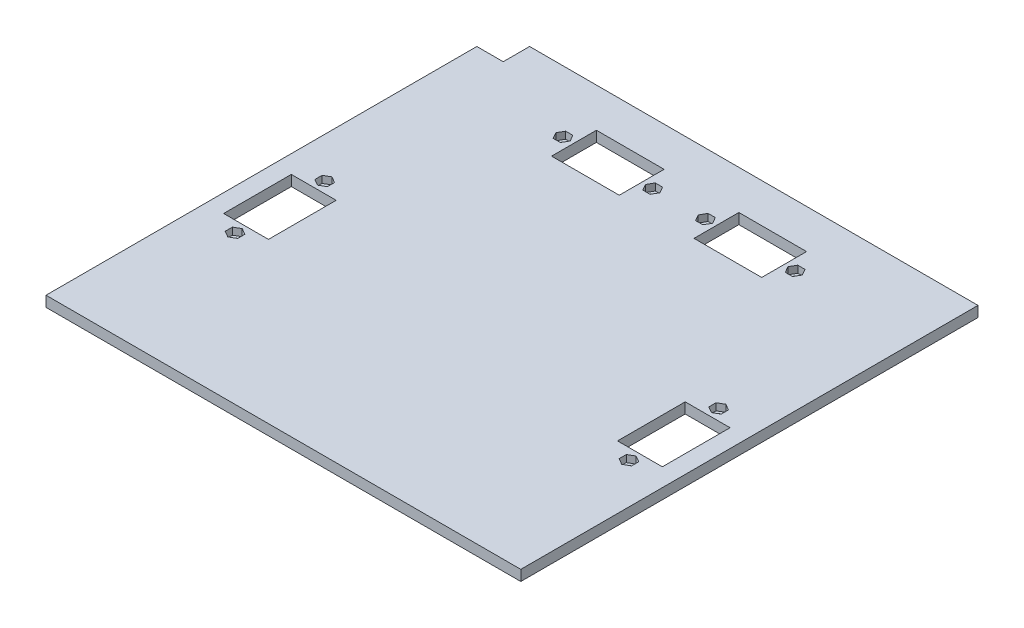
from build123d import *

# Parameters (mm, degrees)
SKETCH1_W           = 270
SKETCH1_H           = 260
BOSS_EXTRUDE1_DEPTH = 6
SKETCH2_R           = 2
SKETCH2_W           = 25.5
SKETCH2_H           = 38.5
SKETCH2_W_2         = 38.5
SKETCH2_H_2         = 25.5
CUT_EXTRUDE1_DEPTH  = 10
CUT_EXTRUDE2_DEPTH  = 4
SKETCH4_W           = 15
SKETCH4_H           = 15
CUT_EXTRUDE3_DEPTH  = 188.512666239


with BuildPart() as part:
    # Sketch1 → Boss-Extrude1 (new body)
    with BuildSketch(Plane(origin=(0, 0, 0), x_dir=(1, 0, 0), z_dir=(0, 1, 0))):
        Rectangle(SKETCH1_W, SKETCH1_H)
    extrude(amount=BOSS_EXTRUDE1_DEPTH)

    # Sketch2 → Cut-Extrude1 (cut)
    with BuildSketch(Plane(origin=(0, 6, 0), x_dir=(1, 0, 0), z_dir=(0, 1, 0))):
        with Locations(Location((-112, 5.5, 0), (0, 0, 270))):
            Circle(SKETCH2_R)
        with Locations(Location((-112, -45.5, 0), (0, 0, 270))):
            Circle(SKETCH2_R)
        with Locations(Location((-66, 95, 0), (0, 0, 270))):
            Circle(SKETCH2_R)
        with Locations(Location((-15, 95, 0), (0, 0, 270))):
            Circle(SKETCH2_R)
        with Locations(Location((112, -45.5, 0), (0, 0, 90))):
            Circle(SKETCH2_R)
        with Locations(Location((112, 5.5, 0), (0, 0, 90))):
            Circle(SKETCH2_R)
        with Locations(Location((66, 95, 0), (0, 0, 90))):
            Circle(SKETCH2_R)
        with Locations(Location((15, 95, 0), (0, 0, 90))):
            Circle(SKETCH2_R)
        with Locations((-112, -20)):
            Rectangle(SKETCH2_W, SKETCH2_H)
        with Locations((-40.5, 95)):
            Rectangle(SKETCH2_W_2, SKETCH2_H_2)
        with Locations((112, -20)):
            Rectangle(SKETCH2_W, SKETCH2_H)
        with Locations((40.5, 95)):
            Rectangle(SKETCH2_W_2, SKETCH2_H_2)
    extrude(amount=-CUT_EXTRUDE1_DEPTH, mode=Mode.SUBTRACT)

    # Sketch3 → Cut-Extrude2 (cut)
    with BuildSketch(Plane(origin=(0, 6, 0), x_dir=(1, 0, 0), z_dir=(0, 1, 0))):
        Polygon((-68.049593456, 98.55), (-70.099186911, 95), (-68.049593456, 91.45), (-63.950406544, 91.45), (-61.900813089, 95), (-63.950406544, 98.55), align=None)
        Polygon((-12.950406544, 98.55), (-17.049593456, 98.55), (-19.099186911, 95), (-17.049593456, 91.45), (-12.950406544, 91.45), (-10.900813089, 95), align=None)
        Polygon((12.950406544, 98.55), (10.900813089, 95), (12.950406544, 91.45), (17.049593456, 91.45), (19.099186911, 95), (17.049593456, 98.55), align=None)
        Polygon((63.950406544, 98.55), (61.900813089, 95), (63.950406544, 91.45), (68.049593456, 91.45), (70.099186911, 95), (68.049593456, 98.55), align=None)
        Polygon((115.55, 7.549593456), (112, 9.599186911), (108.45, 7.549593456), (108.45, 3.450406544), (112, 1.400813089), (115.55, 3.450406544), align=None)
        Polygon((115.55, -47.549593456), (115.55, -43.450406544), (112, -41.400813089), (108.45, -43.450406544), (108.45, -47.549593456), (112, -49.599186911), align=None)
        Polygon((-108.45, 7.549593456), (-112, 9.599186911), (-115.55, 7.549593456), (-115.55, 3.450406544), (-112, 1.400813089), (-108.45, 3.450406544), align=None)
        Polygon((-108.45, -43.450406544), (-112, -41.400813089), (-115.55, -43.450406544), (-115.55, -47.549593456), (-112, -49.599186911), (-108.45, -47.549593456), align=None)
    extrude(amount=-CUT_EXTRUDE2_DEPTH, mode=Mode.SUBTRACT)

    # Sketch4 → Cut-Extrude3 (cut, through all)
    with BuildSketch(Plane(origin=(0, 6, 0), x_dir=(1, 0, 0), z_dir=(0, 1, 0))):
        with Locations((-127.5, 122.5)):
            Rectangle(SKETCH4_W, SKETCH4_H)
    extrude(amount=-CUT_EXTRUDE3_DEPTH, mode=Mode.SUBTRACT)


solid = part.part
